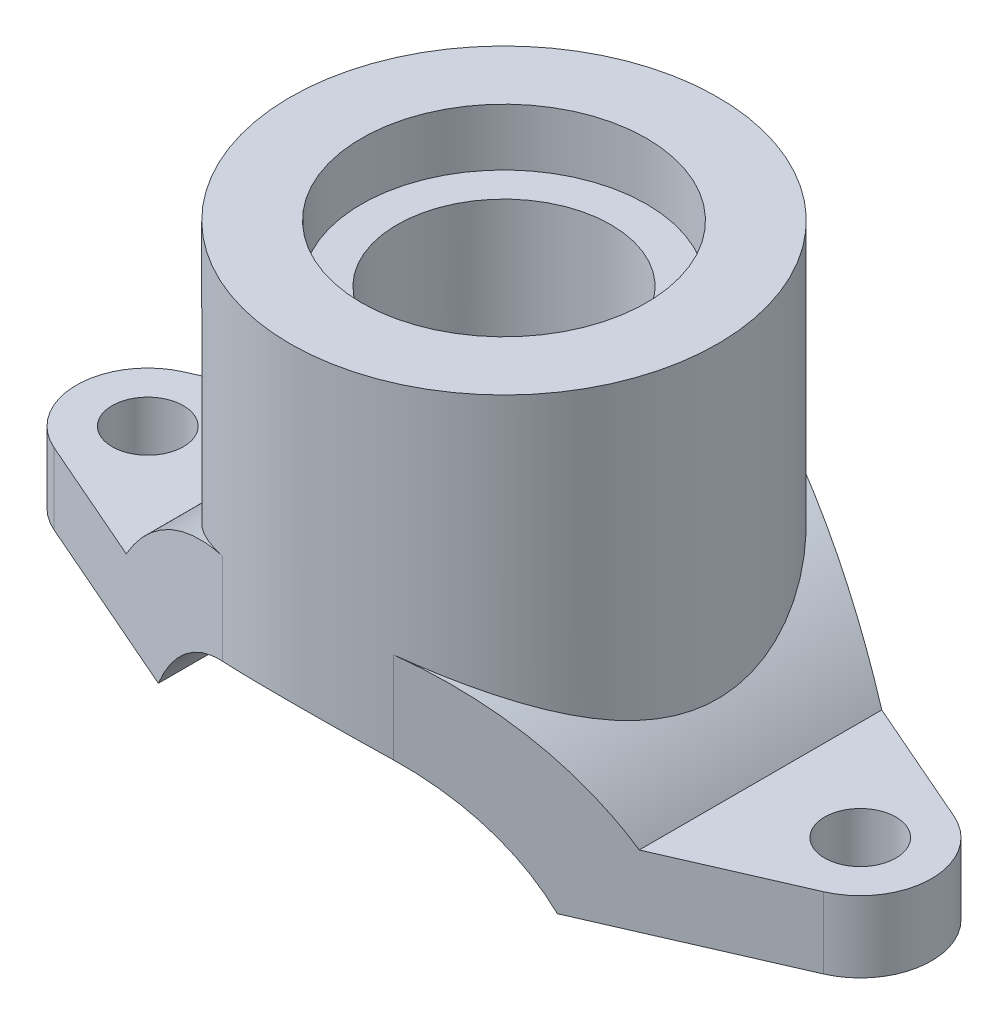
from build123d import *

# Parameters (mm, degrees)
EXTRUDE1_DEPTH     = 75
SKETCH2_OUTSIDE_W  = 370.592
SKETCH2_OUTSIDE_H  = 220.592
CUT_EXTRUDE1_DEPTH = 183.330209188
EXTRUDE2_REACH     = 227
SKETCH3_R          = 75
SKETCH6_R          = 12.5
CUT_EXTRUDE2_DEPTH = 210.165006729


with BuildPart() as part:
    # Sketch1 → Extrude1 (new, symmetric)
    with BuildSketch(Plane.XY):
        with BuildLine():
            Line((-150, 25), (-90, 25))
            ThreePointArc((-90, 25), (0, 71.549319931), (90, 25))
            Line((90, 25), (150, 25))
            Line((150, 25), (150, 0))
            Line((150, 0), (70, 0))
            ThreePointArc((70, 0), (0, 41.270166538), (-70, 0))
            Line((-70, 0), (-150, 0))
            Line((-150, 0), (-150, 25))
        make_face()
    extrude(amount=EXTRUDE1_DEPTH, both=True)

    # Sketch2 outside → Cut-Extrude1 (cut, through all)
    with BuildSketch(Plane(origin=(0, 0, 0), x_dir=(1, 0, 0), z_dir=(0, 1, 0))):
        Rectangle(SKETCH2_OUTSIDE_W, SKETCH2_OUTSIDE_H)
        with BuildLine():
            Line((135, 22.912878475), (30, 68.738635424))
            ThreePointArc((30, 68.738635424), (0, 75), (-30, 68.738635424))
            Line((-30, 68.738635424), (-135, 22.912878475))
            ThreePointArc((-135, 22.912878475), (-150, 0), (-135, -22.912878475))
            Line((-135, -22.912878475), (-30, -68.738635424))
            ThreePointArc((-30, -68.738635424), (0, -75), (30, -68.738635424))
            Line((30, -68.738635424), (135, -22.912878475))
            ThreePointArc((135, -22.912878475), (150, 0), (135, 22.912878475))
        make_face(mode=Mode.SUBTRACT)
    extrude(amount=CUT_EXTRUDE1_DEPTH, mode=Mode.SUBTRACT)

    # Sketch3 → Extrude2 (add, up to next)
    with BuildSketch(Plane(origin=(0, 150, 0), x_dir=(-1, 0, 0), z_dir=(0, 1, 0)), mode=Mode.PRIVATE) as extrude2_sk1:
        with Locations(Location((0, 0, 0), (0, 0, 246.421821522))):
            Circle(SKETCH3_R)
    extrude2_tool1 = extrude(extrude2_sk1.sketch, amount=-EXTRUDE2_REACH, mode=Mode.PRIVATE) - part.part
    add(extrude2_tool1.solids().sort_by_distance((0, 150, 0))[0])

    # Sketch4 → Cut-Revolve1 (revolve, cut)
    with BuildSketch(Plane.XY, mode=Mode.PRIVATE) as cut_revolve1_sk:
        Polygon((0, 150), (50, 150), (50, 130), (37.5, 130), (37.5, 25), (0, 25), align=None)
    revolve(cut_revolve1_sk.sketch.rotate(Axis((0, 0, 0), (0, 1, 0)), 90), axis=Axis((0, 0, 0), (0, 1, 0)), mode=Mode.SUBTRACT)

    # Sketch6 → Cut-Extrude2 (cut, through all)
    with BuildSketch(Plane(origin=(0, 25, 0), x_dir=(-1, 0, 0), z_dir=(0, 1, 0))):
        with Locations(Location((125, 0, 0), (0, 0, 90))):
            Circle(SKETCH6_R)
        with Locations(Location((-125, 0, 0), (0, 0, 270))):
            Circle(SKETCH6_R)
    extrude(amount=-CUT_EXTRUDE2_DEPTH, mode=Mode.SUBTRACT)


solid = part.part
